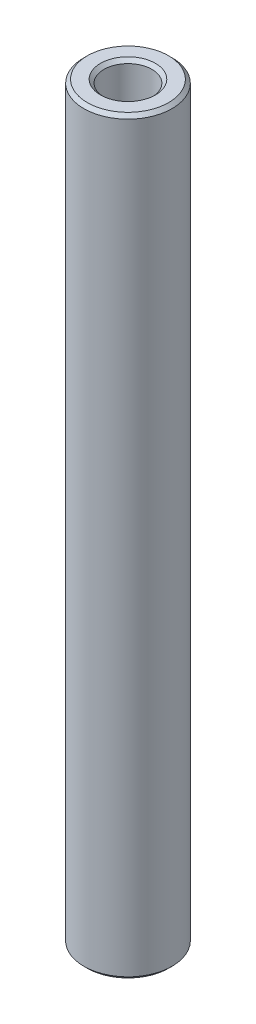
from build123d import *

# Parameters (mm, degrees)
SKETCH1_R      = 3.175
EXTRUDE1_DEPTH = 53.975
SKETCH2_R      = 1.7272
EXTRUDE2_DEPTH = 31.75
CHAMFER1_SIZE  = 0.25


with BuildPart() as part:
    # Sketch1 → Extrude1 (new body)
    with BuildSketch(Plane(origin=(0, 0, 0), x_dir=(1, 0, 0), z_dir=(0, 1, 0))):
        with Locations(Location((0, 0, 0), (0, 0, 270))):
            Circle(SKETCH1_R)
    extrude(amount=EXTRUDE1_DEPTH)

    # Sketch2 → Extrude2 (cut)
    with BuildSketch(Plane(origin=(0, 53.975, 0), x_dir=(1, 0, 0), z_dir=(0, 1, 0))):
        with Locations(Location((0, 0, 0), (0, 0, 270))):
            Circle(SKETCH2_R)
    extrude(amount=-EXTRUDE2_DEPTH, mode=Mode.SUBTRACT)

    # Chamfer1
    chamfer1_edges = [part.edges().sort_by_distance(p)[0] for p in [
        (0, 0, -3.175),
        (0, 53.975, -3.175),
        (0, 53.975, -1.7272),
    ]]
    chamfer(chamfer1_edges, length=CHAMFER1_SIZE)


solid = part.part
